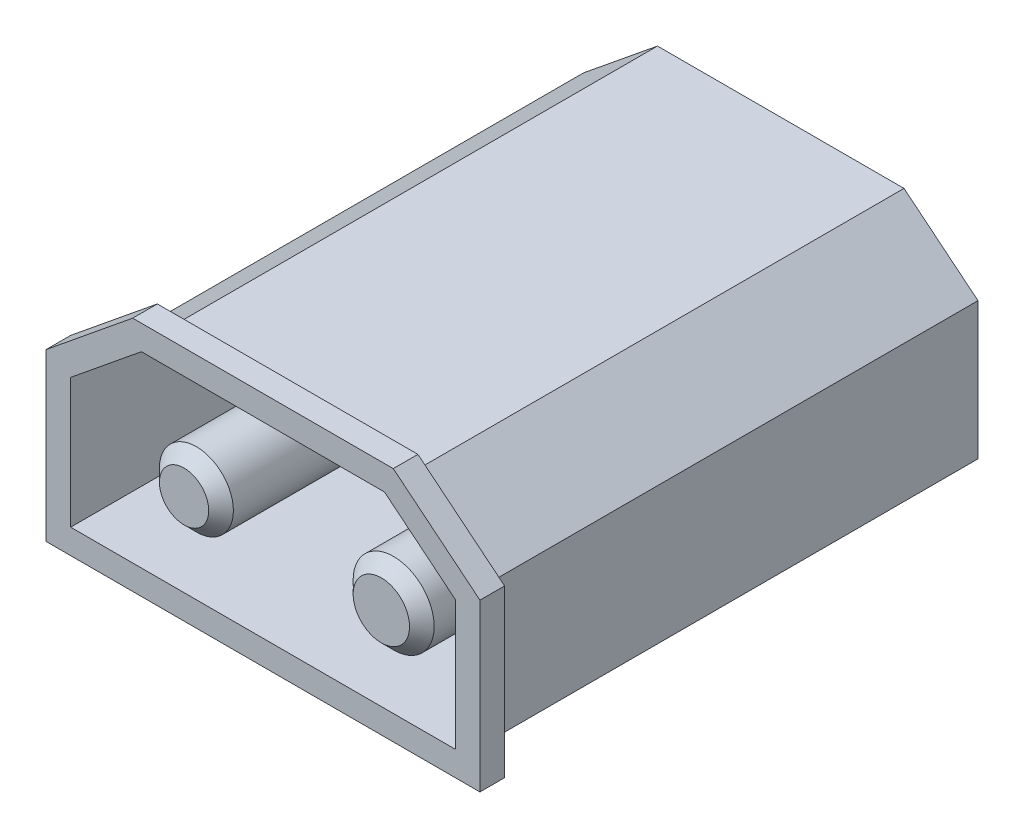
from build123d import *

# Parameters (mm, degrees)
BASE_EXTRUDE_DEPTH  = 20
SHELL1_T            = -0.2
SKETCH2_R           = 1.5
SKETCH2_R_2         = 1.6430481
BOSS_EXTRUDE1_DEPTH = 20
CHAMFER1_SIZE       = 0.5
BOSS_EXTRUDE2_DEPTH = 1


with BuildPart() as part:
    # Sketch1 → Base-Extrude (new body)
    with BuildSketch(Plane.XY):
        Polygon((-40, -26.94262182), (-37, -24.5), (-27, -24.5), (-24, -26.94262182), (-24, -32.5), (-40, -32.5), align=None)
    extrude(amount=-BASE_EXTRUDE_DEPTH)

    # Shell1
    shell1_openings = [part.faces().sort_by_distance(p)[0] for p in [
        (-32, -28.693458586, 0),
    ]]
    offset(amount=SHELL1_T, openings=shell1_openings, kind=Kind.INTERSECTION)

    # Sketch2 → Boss-Extrude1 (add)
    with BuildSketch(Plane.XY.offset(-19.8)):
        with Locations(Location((-36, -29.72131091, 0), (0, 0, 180))):
            Circle(SKETCH2_R)
        with Locations(Location((-28, -29.72131091, 0), (0, 0, 180))):
            Circle(SKETCH2_R_2)
    extrude(amount=BOSS_EXTRUDE1_DEPTH)

    # Chamfer1
    chamfer1_edges = [part.edges().sort_by_distance(p)[0] for p in [
        (-26.3569519, -29.72131091, 0.2),
        (-34.5, -29.72131091, 0.2),
    ]]
    chamfer(chamfer1_edges, length=CHAMFER1_SIZE)

    # Sketch3 → Boss-Extrude2 (add)
    with BuildSketch(Plane.XY):
        Polygon((-23.2, -33.3), (-40.8, -33.3), (-40.8, -26.562349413), (-37.284495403, -23.7), (-26.715504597, -23.7), (-23.2, -26.562349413), align=None)
        Polygon((-24.2, -32.3), (-39.8, -32.3), (-39.8, -27.037689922), (-36.928876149, -24.7), (-27.071123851, -24.7), (-24.2, -27.037689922), align=None, mode=Mode.SUBTRACT)
    extrude(amount=BOSS_EXTRUDE2_DEPTH)


solid = part.part
